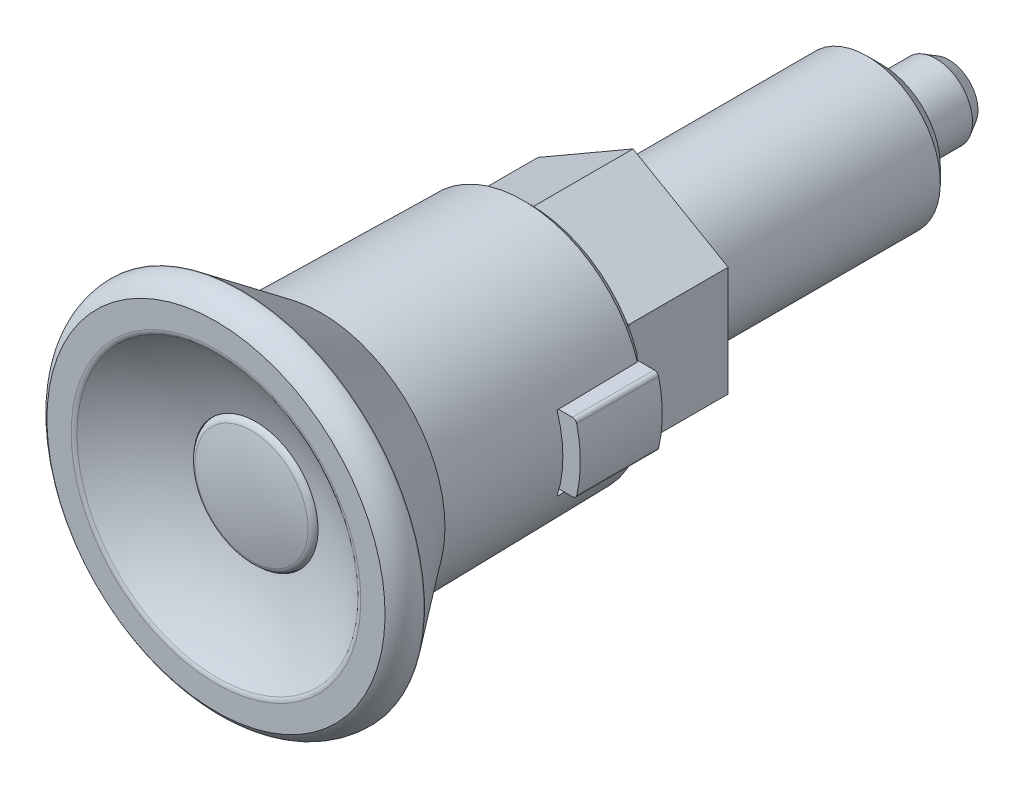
ISO-10303-21;
HEADER;
FILE_DESCRIPTION(('STEP AP214'),'2;1');
FILE_NAME('part.step','',(''),(''),'','','');
FILE_SCHEMA(('AUTOMOTIVE_DESIGN { 1 0 10303 214 1 1 1 1 }'));
ENDSEC;
DATA;
#1=APPLICATION_CONTEXT('core data for automotive mechanical design processes');
#2=APPLICATION_PROTOCOL_DEFINITION('international standard','automotive_design',2000,#1);
#3=PRODUCT_CONTEXT('',#1,'mechanical');
#4=PRODUCT('Part','Part','',(#3));
#5=PRODUCT_RELATED_PRODUCT_CATEGORY('part','',(#4));
#6=PRODUCT_DEFINITION_FORMATION('','',#4);
#7=PRODUCT_DEFINITION_CONTEXT('part definition',#1,'design');
#8=PRODUCT_DEFINITION('design','',#6,#7);
#9=PRODUCT_DEFINITION_SHAPE('','',#8);
#10=(LENGTH_UNIT() NAMED_UNIT(*) SI_UNIT(.MILLI.,.METRE.));
#11=(NAMED_UNIT(*) PLANE_ANGLE_UNIT() SI_UNIT($,.RADIAN.));
#12=(NAMED_UNIT(*) SI_UNIT($,.STERADIAN.) SOLID_ANGLE_UNIT());
#13=UNCERTAINTY_MEASURE_WITH_UNIT(LENGTH_MEASURE(1.E-05),#10,'distance_accuracy_value','');
#14=(GEOMETRIC_REPRESENTATION_CONTEXT(3) GLOBAL_UNCERTAINTY_ASSIGNED_CONTEXT((#13)) GLOBAL_UNIT_ASSIGNED_CONTEXT((#10,
#11,#12)) REPRESENTATION_CONTEXT('',''));
#15=CARTESIAN_POINT('',(0.,0.,0.));
#16=DIRECTION('',(0.,0.,1.));
#17=DIRECTION('',(1.,0.,0.));
#18=AXIS2_PLACEMENT_3D('',#15,#16,#17);
#19=CARTESIAN_POINT('',(6.,-3.05,13.1));
#20=DIRECTION('',(0.,0.,1.));
#21=DIRECTION('',(0.,-1.,0.));
#22=AXIS2_PLACEMENT_3D('',#19,#20,#21);
#23=PLANE('',#22);
#24=DIRECTION('',(0.,-1.,0.));
#25=VECTOR('',#24,1.);
#26=CARTESIAN_POINT('',(6.5,3.05,13.1));
#27=LINE('',#26,#25);
#28=CARTESIAN_POINT('',(6.5,2.55,13.1));
#29=VERTEX_POINT('',#28);
#30=CARTESIAN_POINT('',(6.5,-2.55,13.1));
#31=VERTEX_POINT('',#30);
#32=EDGE_CURVE('E160',#29,#31,#27,.T.);
#33=ORIENTED_EDGE('',*,*,#32,.F.);
#34=DIRECTION('',(-1.,0.,0.));
#35=VECTOR('',#34,1.);
#36=CARTESIAN_POINT('',(12.5,2.55,13.1));
#37=LINE('',#36,#35);
#38=CARTESIAN_POINT('',(7.90538056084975,2.55,13.1));
#39=VERTEX_POINT('',#38);
#40=EDGE_CURVE('E186',#39,#29,#37,.T.);
#41=ORIENTED_EDGE('',*,*,#40,.F.);
#42=CARTESIAN_POINT('',(0.,0.,13.1));
#43=DIRECTION('',(0.,0.,1.));
#44=DIRECTION('',(0.,-1.,0.));
#45=AXIS2_PLACEMENT_3D('',#42,#43,#44);
#46=CIRCLE('',#45,8.30647589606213);
#47=CARTESIAN_POINT('',(7.90538056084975,-2.55,13.1));
#48=VERTEX_POINT('',#47);
#49=EDGE_CURVE('E285',#48,#39,#46,.T.);
#50=ORIENTED_EDGE('',*,*,#49,.F.);
#51=DIRECTION('',(1.,0.,0.));
#52=VECTOR('',#51,1.);
#53=CARTESIAN_POINT('',(6.5,-2.55,13.1));
#54=LINE('',#53,#52);
#55=EDGE_CURVE('E184',#31,#48,#54,.T.);
#56=ORIENTED_EDGE('',*,*,#55,.F.);
#57=EDGE_LOOP('',(#33,#41,#50,#56));
#58=FACE_BOUND('',#57,.T.);
#59=ADVANCED_FACE('F14',(#58),#23,.F.);
#60=CARTESIAN_POINT('',(5.9,-2.95,12.8));
#61=DIRECTION('',(0.,0.,1.));
#62=DIRECTION('',(0.,-1.,0.));
#63=AXIS2_PLACEMENT_3D('',#60,#61,#62);
#64=PLANE('',#63);
#65=DIRECTION('',(-1.,0.,0.));
#66=VECTOR('',#65,1.);
#67=CARTESIAN_POINT('',(8.65789109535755,2.35,12.8));
#68=LINE('',#67,#66);
#69=CARTESIAN_POINT('',(8.65789109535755,2.35,12.8));
#70=VERTEX_POINT('',#69);
#71=CARTESIAN_POINT('',(6.5,2.35,12.8));
#72=VERTEX_POINT('',#71);
#73=EDGE_CURVE('E513',#70,#72,#68,.T.);
#74=ORIENTED_EDGE('',*,*,#73,.T.);
#75=DIRECTION('',(0.,-1.,0.));
#76=VECTOR('',#75,1.);
#77=CARTESIAN_POINT('',(6.5,-2.95,12.8));
#78=LINE('',#77,#76);
#79=CARTESIAN_POINT('',(6.5,-2.35,12.8));
#80=VERTEX_POINT('',#79);
#81=EDGE_CURVE('E178',#72,#80,#78,.T.);
#82=ORIENTED_EDGE('',*,*,#81,.T.);
#83=DIRECTION('',(1.,0.,0.));
#84=VECTOR('',#83,1.);
#85=CARTESIAN_POINT('',(6.5,-2.35,12.8));
#86=LINE('',#85,#84);
#87=CARTESIAN_POINT('',(8.65789109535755,-2.35,12.8));
#88=VERTEX_POINT('',#87);
#89=EDGE_CURVE('E517',#80,#88,#86,.T.);
#90=ORIENTED_EDGE('',*,*,#89,.T.);
#91=CARTESIAN_POINT('',(8.65789109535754,-2.05,12.8));
#92=DIRECTION('',(0.,0.,1.));
#93=DIRECTION('',(1.,0.,0.));
#94=AXIS2_PLACEMENT_3D('',#91,#92,#93);
#95=CIRCLE('',#94,0.3);
#96=CARTESIAN_POINT('',(8.94963738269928,-2.11988636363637,12.8));
#97=VERTEX_POINT('',#96);
#98=EDGE_CURVE('E531',#88,#97,#95,.T.);
#99=ORIENTED_EDGE('',*,*,#98,.T.);
#100=CARTESIAN_POINT('',(0.100000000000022,0.,12.8));
#101=DIRECTION('',(0.,0.,1.));
#102=DIRECTION('',(1.,0.,0.));
#103=AXIS2_PLACEMENT_3D('',#100,#101,#102);
#104=CIRCLE('',#103,9.1);
#105=CARTESIAN_POINT('',(8.94963738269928,2.11988636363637,12.8));
#106=VERTEX_POINT('',#105);
#107=EDGE_CURVE('E529',#97,#106,#104,.T.);
#108=ORIENTED_EDGE('',*,*,#107,.T.);
#109=CARTESIAN_POINT('',(8.65789109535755,2.05,12.8));
#110=DIRECTION('',(0.,0.,1.));
#111=DIRECTION('',(1.,0.,0.));
#112=AXIS2_PLACEMENT_3D('',#109,#110,#111);
#113=CIRCLE('',#112,0.3);
#114=EDGE_CURVE('E527',#106,#70,#113,.T.);
#115=ORIENTED_EDGE('',*,*,#114,.T.);
#116=EDGE_LOOP('',(#74,#82,#90,#99,#108,#115));
#117=FACE_BOUND('',#116,.T.);
#118=ADVANCED_FACE('F269',(#117),#64,.T.);
#119=CARTESIAN_POINT('',(5.9,-2.95,7.2));
#120=DIRECTION('',(0.,0.,1.));
#121=DIRECTION('',(0.,-1.,0.));
#122=AXIS2_PLACEMENT_3D('',#119,#120,#121);
#123=PLANE('',#122);
#124=DIRECTION('',(0.,-1.,0.));
#125=VECTOR('',#124,1.);
#126=CARTESIAN_POINT('',(6.5,-2.95,7.2));
#127=LINE('',#126,#125);
#128=CARTESIAN_POINT('',(6.5,2.35,7.2));
#129=VERTEX_POINT('',#128);
#130=CARTESIAN_POINT('',(6.5,-2.35,7.2));
#131=VERTEX_POINT('',#130);
#132=EDGE_CURVE('E9',#129,#131,#127,.T.);
#133=ORIENTED_EDGE('',*,*,#132,.F.);
#134=DIRECTION('',(-1.,0.,0.));
#135=VECTOR('',#134,1.);
#136=CARTESIAN_POINT('',(8.65789109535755,2.35,7.2));
#137=LINE('',#136,#135);
#138=CARTESIAN_POINT('',(8.65789109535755,2.35,7.2));
#139=VERTEX_POINT('',#138);
#140=EDGE_CURVE('E514',#139,#129,#137,.T.);
#141=ORIENTED_EDGE('',*,*,#140,.F.);
#142=CARTESIAN_POINT('',(8.65789109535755,2.05,7.2));
#143=DIRECTION('',(0.,0.,1.));
#144=DIRECTION('',(1.,0.,0.));
#145=AXIS2_PLACEMENT_3D('',#142,#143,#144);
#146=CIRCLE('',#145,0.3);
#147=CARTESIAN_POINT('',(8.94963738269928,2.11988636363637,7.2));
#148=VERTEX_POINT('',#147);
#149=EDGE_CURVE('E518',#148,#139,#146,.T.);
#150=ORIENTED_EDGE('',*,*,#149,.F.);
#151=CARTESIAN_POINT('',(0.100000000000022,0.,7.2));
#152=DIRECTION('',(0.,0.,1.));
#153=DIRECTION('',(1.,0.,0.));
#154=AXIS2_PLACEMENT_3D('',#151,#152,#153);
#155=CIRCLE('',#154,9.1);
#156=CARTESIAN_POINT('',(8.94963738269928,-2.11988636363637,7.2));
#157=VERTEX_POINT('',#156);
#158=EDGE_CURVE('E520',#157,#148,#155,.T.);
#159=ORIENTED_EDGE('',*,*,#158,.F.);
#160=CARTESIAN_POINT('',(8.65789109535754,-2.05,7.2));
#161=DIRECTION('',(0.,0.,1.));
#162=DIRECTION('',(1.,0.,0.));
#163=AXIS2_PLACEMENT_3D('',#160,#161,#162);
#164=CIRCLE('',#163,0.3);
#165=CARTESIAN_POINT('',(8.65789109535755,-2.35,7.2));
#166=VERTEX_POINT('',#165);
#167=EDGE_CURVE('E522',#166,#157,#164,.T.);
#168=ORIENTED_EDGE('',*,*,#167,.F.);
#169=DIRECTION('',(1.,0.,0.));
#170=VECTOR('',#169,1.);
#171=CARTESIAN_POINT('',(6.5,-2.35,7.2));
#172=LINE('',#171,#170);
#173=EDGE_CURVE('E524',#131,#166,#172,.T.);
#174=ORIENTED_EDGE('',*,*,#173,.F.);
#175=EDGE_LOOP('',(#133,#141,#150,#159,#168,#174));
#176=FACE_BOUND('',#175,.T.);
#177=ADVANCED_FACE('F274',(#176),#123,.F.);
#178=CARTESIAN_POINT('',(0.,0.,41.2));
#179=DIRECTION('',(0.,0.,-1.));
#180=DIRECTION('',(-1.,0.,0.));
#181=AXIS2_PLACEMENT_3D('',#178,#179,#180);
#182=SPHERICAL_SURFACE('',#181,16.);
#183=CARTESIAN_POINT('',(0.,0.,28.4));
#184=DIRECTION('',(0.,0.,-1.));
#185=DIRECTION('',(0.,1.,0.));
#186=AXIS2_PLACEMENT_3D('',#183,#184,#185);
#187=CIRCLE('',#186,9.6);
#188=CARTESIAN_POINT('',(-9.59999999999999,0.,28.4));
#189=VERTEX_POINT('',#188);
#190=EDGE_CURVE('E286',#189,#189,#187,.T.);
#191=CARTESIAN_POINT('',(0.,0.,25.7747771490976));
#192=DIRECTION('',(0.,0.,1.));
#193=DIRECTION('',(0.,-1.,0.));
#194=AXIS2_PLACEMENT_3D('',#191,#192,#193);
#195=CIRCLE('',#194,4.25);
#196=CARTESIAN_POINT('',(-4.24999999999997,0.,25.7747771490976));
#197=VERTEX_POINT('',#196);
#198=EDGE_CURVE('E476',#197,#197,#195,.T.);
#199=CARTESIAN_POINT('',(-9.59999999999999,0.,28.4));
#200=CARTESIAN_POINT('',(-9.55004681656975,0.,28.3625350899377));
#201=CARTESIAN_POINT('',(-9.49987429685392,0.,28.3253626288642));
#202=CARTESIAN_POINT('',(-9.39909750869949,0.,28.2516076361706));
#203=CARTESIAN_POINT('',(-9.34849324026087,0.,28.2150251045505));
#204=CARTESIAN_POINT('',(-9.24685987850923,0.,28.1424550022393));
#205=CARTESIAN_POINT('',(-9.19583078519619,0.,28.1064674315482));
#206=CARTESIAN_POINT('',(-9.09335477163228,0.,28.0350921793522));
#207=CARTESIAN_POINT('',(-9.04190785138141,0.,27.9997044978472));
#208=CARTESIAN_POINT('',(-8.93860323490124,0.,27.929533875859));
#209=CARTESIAN_POINT('',(-8.88674553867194,0.,27.8947509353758));
#210=CARTESIAN_POINT('',(-8.78262647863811,0.,27.8257945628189));
#211=CARTESIAN_POINT('',(-8.73036511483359,0.,27.7916211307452));
#212=CARTESIAN_POINT('',(-8.62544588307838,0.,27.7238884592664));
#213=CARTESIAN_POINT('',(-8.57278801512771,0.,27.6903292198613));
#214=CARTESIAN_POINT('',(-8.46708299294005,0.,27.6238295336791));
#215=CARTESIAN_POINT('',(-8.41403583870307,0.,27.5908890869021));
#216=CARTESIAN_POINT('',(-8.30755951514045,0.,27.5256315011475));
#217=CARTESIAN_POINT('',(-8.2541303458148,0.,27.4933143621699));
#218=CARTESIAN_POINT('',(-8.14689731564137,0.,27.4293078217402));
#219=CARTESIAN_POINT('',(-8.09309345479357,0.,27.3976184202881));
#220=CARTESIAN_POINT('',(-7.98511841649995,0.,27.3348716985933));
#221=CARTESIAN_POINT('',(-7.93094723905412,0.,27.3038143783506));
#222=CARTESIAN_POINT('',(-7.82224499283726,0.,27.2423360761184));
#223=CARTESIAN_POINT('',(-7.76771392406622,0.,27.2119150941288));
#224=CARTESIAN_POINT('',(-7.65829936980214,0.,27.1517136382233));
#225=CARTESIAN_POINT('',(-7.60341588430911,0.,27.1219331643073));
#226=CARTESIAN_POINT('',(-7.49330401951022,0.,27.0630168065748));
#227=CARTESIAN_POINT('',(-7.43807564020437,0.,27.0338809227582));
#228=CARTESIAN_POINT('',(-7.32728155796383,0.,26.9762577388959));
#229=CARTESIAN_POINT('',(-7.27171585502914,0.,26.9477704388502));
#230=CARTESIAN_POINT('',(-7.16025474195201,0.,26.8914483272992));
#231=CARTESIAN_POINT('',(-7.10435933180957,0.,26.863613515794));
#232=CARTESIAN_POINT('',(-6.99224646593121,0.,26.8086001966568));
#233=CARTESIAN_POINT('',(-6.93602901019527,0.,26.7814216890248));
#234=CARTESIAN_POINT('',(-6.82327975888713,0.,26.7277247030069));
#235=CARTESIAN_POINT('',(-6.76674796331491,0.,26.701206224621));
#236=CARTESIAN_POINT('',(-6.65337778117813,0.,26.6488329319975));
#237=CARTESIAN_POINT('',(-6.59653939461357,0.,26.6229781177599));
#238=CARTESIAN_POINT('',(-6.48256382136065,0.,26.5719356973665));
#239=CARTESIAN_POINT('',(-6.42542663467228,0.,26.5467480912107));
#240=CARTESIAN_POINT('',(-6.31086129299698,0.,26.4970435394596));
#241=CARTESIAN_POINT('',(-6.25343313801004,0.,26.4725265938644));
#242=CARTESIAN_POINT('',(-6.13829373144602,0.,26.4241667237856));
#243=CARTESIAN_POINT('',(-6.08058247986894,0.,26.400323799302));
#244=CARTESIAN_POINT('',(-5.96488479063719,0.,26.3533152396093));
#245=CARTESIAN_POINT('',(-5.90689835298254,0.,26.3301496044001));
#246=CARTESIAN_POINT('',(-5.79065823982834,0.,26.2844987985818));
#247=CARTESIAN_POINT('',(-5.73240456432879,0.,26.2620136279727));
#248=CARTESIAN_POINT('',(-5.61563796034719,0.,26.2177268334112));
#249=CARTESIAN_POINT('',(-5.55712503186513,0.,26.1959252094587));
#250=CARTESIAN_POINT('',(-5.43984794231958,0.,26.1530084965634));
#251=CARTESIAN_POINT('',(-5.38108378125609,0.,26.1318934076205));
#252=CARTESIAN_POINT('',(-5.26331228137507,0.,26.0903526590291));
#253=CARTESIAN_POINT('',(-5.20430494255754,0.,26.0699269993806));
#254=CARTESIAN_POINT('',(-5.08605517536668,0.,26.0297679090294));
#255=CARTESIAN_POINT('',(-5.02681274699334,0.,26.0100344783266));
#256=CARTESIAN_POINT('',(-4.9081009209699,0.,25.9712625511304));
#257=CARTESIAN_POINT('',(-4.84863152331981,0.,25.952224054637));
#258=CARTESIAN_POINT('',(-4.72947391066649,0.,25.9148446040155));
#259=CARTESIAN_POINT('',(-4.66978569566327,0.,25.8965036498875));
#260=CARTESIAN_POINT('',(-4.55019862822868,0.,25.8605218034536));
#261=CARTESIAN_POINT('',(-4.4902997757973,0.,25.8428809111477));
#262=CARTESIAN_POINT('',(-4.37029964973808,0.,25.8083015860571));
#263=CARTESIAN_POINT('',(-4.31019837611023,0.,25.7913631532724));
#264=CARTESIAN_POINT('',(-4.24999999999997,0.,25.7747771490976));
#265=B_SPLINE_CURVE_WITH_KNOTS('',3,(#199,#200,#201,#202,#203,#204,#205,#206,#207,#208,#209,
#210,#211,#212,#213,#214,#215,#216,#217,#218,#219,#220,#221,#222,#223,#224,#225,#226,#227,#228,
#229,#230,#231,#232,#233,#234,#235,#236,#237,#238,#239,#240,#241,#242,#243,#244,#245,#246,#247,
#248,#249,#250,#251,#252,#253,#254,#255,#256,#257,#258,#259,#260,#261,#262,#263,#264),
.UNSPECIFIED.,.F.,.F.,(4,2,2,2,2,2,2,2,2,2,2,2,2,2,2,2,2,2,2,2,2,2,2,2,2,2,2,2,2,2,2,2,4),(0.,
0.187323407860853,0.374646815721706,0.561970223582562,0.749293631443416,0.936617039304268,
1.12394044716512,1.31126385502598,1.49858726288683,1.68591067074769,1.87323407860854,
2.0605574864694,2.24788089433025,2.43520430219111,2.62252771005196,2.80985111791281,
2.99717452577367,3.18449793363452,3.37182134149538,3.55914474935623,3.74646815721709,
3.93379156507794,4.12111497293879,4.30843838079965,4.4957617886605,4.68308519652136,
4.87040860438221,5.05773201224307,5.24505542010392,5.43237882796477,5.61970223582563,
5.80702564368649,5.99434905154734),.UNSPECIFIED.);
#266=EDGE_CURVE('BSEAM16',#189,#197,#265,.T.);
#267=ORIENTED_EDGE('',*,*,#190,.F.);
#268=ORIENTED_EDGE('',*,*,#198,.F.);
#269=ORIENTED_EDGE('',*,*,#266,.T.);
#270=ORIENTED_EDGE('',*,*,#266,.F.);
#271=EDGE_LOOP('',(#267,#269,#268,#270));
#272=FACE_BOUND('',#271,.T.);
#273=ADVANCED_FACE('F16',(#272),#182,.F.);
#274=CARTESIAN_POINT('',(0.,0.,7.));
#275=DIRECTION('',(0.,0.,-1.));
#276=DIRECTION('',(0.,1.,0.));
#277=AXIS2_PLACEMENT_3D('',#274,#275,#276);
#278=CONICAL_SURFACE('',#277,6.5,1.36135681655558);
#279=CARTESIAN_POINT('',(-6.5,9.96304015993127,5.85306843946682));
#280=CARTESIAN_POINT('',(-6.5,9.66752036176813,5.90566321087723));
#281=CARTESIAN_POINT('',(-6.5,9.3718825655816,5.95760662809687));
#282=CARTESIAN_POINT('',(-6.5,8.78031384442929,6.05984354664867));
#283=CARTESIAN_POINT('',(-6.5,8.48438291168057,6.11013700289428));
#284=CARTESIAN_POINT('',(-6.5,7.89200816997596,6.20875363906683));
#285=CARTESIAN_POINT('',(-6.5,7.59556415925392,6.25707561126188));
#286=CARTESIAN_POINT('',(-6.5,7.00228457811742,6.35125145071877));
#287=CARTESIAN_POINT('',(-6.5,6.70544900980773,6.39710533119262));
#288=CARTESIAN_POINT('',(-6.5,6.11278728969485,6.4855480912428));
#289=CARTESIAN_POINT('',(-6.5,5.81696338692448,6.52815196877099));
#290=CARTESIAN_POINT('',(-6.5,5.22480385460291,6.60963457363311));
#291=CARTESIAN_POINT('',(-6.5,4.92846823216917,6.6485133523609));
#292=CARTESIAN_POINT('',(-6.5,4.33524852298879,6.72168768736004));
#293=CARTESIAN_POINT('',(-6.5,4.03836447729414,6.75598357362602));
#294=CARTESIAN_POINT('',(-6.5,3.44399920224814,6.81900415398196));
#295=CARTESIAN_POINT('',(-6.5,3.14651797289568,6.84772884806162));
#296=CARTESIAN_POINT('',(-6.5,2.54890034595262,6.89871709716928));
#297=CARTESIAN_POINT('',(-6.5,2.24875991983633,6.92093410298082));
#298=CARTESIAN_POINT('',(-6.5,1.64800063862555,6.95759663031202));
#299=CARTESIAN_POINT('',(-6.5,1.34738178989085,6.97204225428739));
#300=CARTESIAN_POINT('',(-6.5,0.745934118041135,6.99236327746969));
#301=CARTESIAN_POINT('',(-6.5,0.445105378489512,6.9982411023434));
#302=CARTESIAN_POINT('',(-6.5,-0.1565946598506,7.00107848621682));
#303=CARTESIAN_POINT('',(-6.5,-0.457465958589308,6.99803805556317));
#304=CARTESIAN_POINT('',(-6.5,-1.05968701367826,6.98320817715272));
#305=CARTESIAN_POINT('',(-6.5,-1.36103626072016,6.97139844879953));
#306=CARTESIAN_POINT('',(-6.5,-1.96330463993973,6.93968543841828));
#307=CARTESIAN_POINT('',(-6.5,-2.26422376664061,6.91978205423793));
#308=CARTESIAN_POINT('',(-6.5,-2.86561811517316,6.87286386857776));
#309=CARTESIAN_POINT('',(-6.5,-3.16609311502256,6.84584626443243));
#310=CARTESIAN_POINT('',(-6.5,-3.76643560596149,6.78580284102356));
#311=CARTESIAN_POINT('',(-6.5,-4.06630309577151,6.75277700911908));
#312=CARTESIAN_POINT('',(-6.5,-4.65450400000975,6.68306611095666));
#313=CARTESIAN_POINT('',(-6.5,-4.94285868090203,6.64655873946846));
#314=CARTESIAN_POINT('',(-6.5,-5.51906781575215,6.56977109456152));
#315=CARTESIAN_POINT('',(-6.5,-5.80692225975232,6.52949074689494));
#316=CARTESIAN_POINT('',(-6.5,-6.38220087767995,6.44585349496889));
#317=CARTESIAN_POINT('',(-6.5,-6.66962502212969,6.40249638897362));
#318=CARTESIAN_POINT('',(-6.5,-7.24408456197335,6.31327286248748));
#319=CARTESIAN_POINT('',(-6.5,-7.53111995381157,6.26740641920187));
#320=CARTESIAN_POINT('',(-6.5,-8.39184474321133,6.12673714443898));
#321=CARTESIAN_POINT('',(-6.5,-8.96503469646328,6.02888194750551));
#322=CARTESIAN_POINT('',(-6.5,-10.1104163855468,5.82768949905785));
#323=CARTESIAN_POINT('',(-6.5,-10.6826081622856,5.72435247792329));
#324=CARTESIAN_POINT('',(-6.5,-11.8226483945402,5.51451133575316));
#325=CARTESIAN_POINT('',(-6.5,-12.3905013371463,5.40803152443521));
#326=CARTESIAN_POINT('',(-6.5,-13.5256959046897,5.19234893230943));
#327=CARTESIAN_POINT('',(-6.5,-14.093037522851,5.08314611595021));
#328=CARTESIAN_POINT('',(-6.5,-15.2268150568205,4.86284069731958));
#329=CARTESIAN_POINT('',(-6.5,-15.7932513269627,4.7517399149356));
#330=CARTESIAN_POINT('',(-6.5,-16.9258075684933,4.52800454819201));
#331=CARTESIAN_POINT('',(-6.5,-17.4919275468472,4.41536999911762));
#332=CARTESIAN_POINT('',(-6.5,-18.0579385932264,4.30219733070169));
#333=B_SPLINE_CURVE_WITH_KNOTS('',3,(#279,#280,#281,#282,#283,#284,#285,#286,#287,#288,#289,
#290,#291,#292,#293,#294,#295,#296,#297,#298,#299,#300,#301,#302,#303,#304,#305,#306,#307,#308,
#309,#310,#311,#312,#313,#314,#315,#316,#317,#318,#319,#320,#321,#322,#323,#324,#325,#326,#327,
#328,#329,#330,#331,#332),.UNSPECIFIED.,.F.,.F.,(4,2,2,2,2,2,2,2,2,2,2,2,2,2,2,2,2,2,2,2,2,2,2,
2,2,2,4),(0.,0.900493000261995,1.80101058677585,2.70207179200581,3.60312817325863,
4.49973722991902,5.39633391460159,6.2928660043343,7.18939809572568,8.09219464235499,
8.99497928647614,9.89750828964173,10.8000362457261,11.7046579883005,12.6092911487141,
13.5142812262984,14.4192732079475,15.2912129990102,16.1631699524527,17.0351841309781,
17.9072062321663,19.6516084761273,21.3959374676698,23.1291775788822,24.862440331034,
26.5941252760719,28.3257704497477),.UNSPECIFIED.);
#334=CARTESIAN_POINT('',(-6.5,-3.75277674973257,6.78626300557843));
#335=VERTEX_POINT('',#334);
#336=CARTESIAN_POINT('',(-6.5,0.,7.));
#337=VERTEX_POINT('',#336);
#338=EDGE_CURVE('E393',#335,#337,#333,.F.);
#339=ORIENTED_EDGE('',*,*,#338,.F.);
#340=CARTESIAN_POINT('',(0.0002,-7.50566896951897,6.78623846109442));
#341=CARTESIAN_POINT('',(-0.27007835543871,-7.3496236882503,6.81942161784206));
#342=CARTESIAN_POINT('',(-0.540667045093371,-7.19339923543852,6.84951936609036));
#343=CARTESIAN_POINT('',(-1.08244634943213,-6.88060280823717,6.90236604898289));
#344=CARTESIAN_POINT('',(-1.35363709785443,-6.72403075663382,6.92511314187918));
#345=CARTESIAN_POINT('',(-1.89558215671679,-6.41113863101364,6.96200252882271));
#346=CARTESIAN_POINT('',(-2.16633501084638,-6.25481939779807,6.97617261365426));
#347=CARTESIAN_POINT('',(-2.70805859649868,-5.94205513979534,6.99517079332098));
#348=CARTESIAN_POINT('',(-2.97902929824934,-5.7856101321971,7.));
#349=CARTESIAN_POINT('',(-3.52097070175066,-5.47272011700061,7.));
#350=CARTESIAN_POINT('',(-3.79194140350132,-5.31627510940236,6.99517079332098));
#351=CARTESIAN_POINT('',(-4.33366498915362,-5.00351085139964,6.97617261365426));
#352=CARTESIAN_POINT('',(-4.60441784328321,-4.84719161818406,6.96200252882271));
#353=CARTESIAN_POINT('',(-5.14636290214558,-4.53429949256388,6.92511314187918));
#354=CARTESIAN_POINT('',(-5.41755365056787,-4.37772744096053,6.90236604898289));
#355=CARTESIAN_POINT('',(-5.95933295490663,-4.06493101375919,6.84951936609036));
#356=CARTESIAN_POINT('',(-6.22992164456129,-3.9087065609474,6.81942161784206));
#357=CARTESIAN_POINT('',(-6.5002,-3.75266127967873,6.78623846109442));
#358=B_SPLINE_CURVE_WITH_KNOTS('',3,(#340,#341,#342,#343,#344,#345,#346,#347,#348,#349,#350,
#351,#352,#353,#354,#355,#356,#357),.UNSPECIFIED.,.F.,.F.,(4,2,2,2,2,2,2,2,4),(0.,
0.941579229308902,1.88339419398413,2.8221409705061,3.76077600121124,4.69941103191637,
5.63815780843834,6.57997277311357,7.52155200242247),.UNSPECIFIED.);
#359=CARTESIAN_POINT('',(-3.25,-5.62916512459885,7.));
#360=VERTEX_POINT('',#359);
#361=EDGE_CURVE('E331',#360,#335,#358,.T.);
#362=ORIENTED_EDGE('',*,*,#361,.F.);
#363=CARTESIAN_POINT('',(0.,0.,7.));
#364=DIRECTION('',(0.,0.,-1.));
#365=DIRECTION('',(0.,1.,0.));
#366=AXIS2_PLACEMENT_3D('',#363,#364,#365);
#367=CIRCLE('',#366,6.5);
#368=EDGE_CURVE('E442',#360,#337,#367,.T.);
#369=ORIENTED_EDGE('',*,*,#368,.T.);
#370=EDGE_LOOP('',(#339,#362,#369));
#371=FACE_BOUND('',#370,.T.);
#372=ADVANCED_FACE('F350',(#371),#278,.T.);
#373=CARTESIAN_POINT('',(-6.5,3.75277674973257,6.78626300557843));
#374=VERTEX_POINT('',#373);
#375=EDGE_CURVE('E394',#337,#374,#333,.F.);
#376=ORIENTED_EDGE('',*,*,#375,.F.);
#377=CARTESIAN_POINT('',(-3.25,5.62916512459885,7.));
#378=VERTEX_POINT('',#377);
#379=EDGE_CURVE('E444',#337,#378,#367,.T.);
#380=ORIENTED_EDGE('',*,*,#379,.T.);
#381=CARTESIAN_POINT('',(-6.5002,3.75266127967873,6.78623846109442));
#382=CARTESIAN_POINT('',(-6.22992164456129,3.9087065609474,6.81942161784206));
#383=CARTESIAN_POINT('',(-5.95933295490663,4.06493101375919,6.84951936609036));
#384=CARTESIAN_POINT('',(-5.41755365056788,4.37772744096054,6.90236604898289));
#385=CARTESIAN_POINT('',(-5.14636290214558,4.53429949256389,6.92511314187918));
#386=CARTESIAN_POINT('',(-4.60441784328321,4.84719161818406,6.96200252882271));
#387=CARTESIAN_POINT('',(-4.33366498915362,5.00351085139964,6.97617261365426));
#388=CARTESIAN_POINT('',(-3.79194140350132,5.31627510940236,6.99517079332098));
#389=CARTESIAN_POINT('',(-3.52097070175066,5.47272011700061,7.));
#390=CARTESIAN_POINT('',(-2.97902929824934,5.7856101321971,7.));
#391=CARTESIAN_POINT('',(-2.70805859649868,5.94205513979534,6.99517079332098));
#392=CARTESIAN_POINT('',(-2.16633501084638,6.25481939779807,6.97617261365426));
#393=CARTESIAN_POINT('',(-1.89558215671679,6.41113863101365,6.96200252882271));
#394=CARTESIAN_POINT('',(-1.35363709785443,6.72403075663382,6.92511314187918));
#395=CARTESIAN_POINT('',(-1.08244634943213,6.88060280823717,6.90236604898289));
#396=CARTESIAN_POINT('',(-0.540667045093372,7.19339923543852,6.84951936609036));
#397=CARTESIAN_POINT('',(-0.27007835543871,7.34962368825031,6.81942161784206));
#398=CARTESIAN_POINT('',(0.00020000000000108,7.50566896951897,6.78623846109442));
#399=B_SPLINE_CURVE_WITH_KNOTS('',3,(#381,#382,#383,#384,#385,#386,#387,#388,#389,#390,#391,
#392,#393,#394,#395,#396,#397,#398),.UNSPECIFIED.,.F.,.F.,(4,2,2,2,2,2,2,2,4),(0.,
0.941579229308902,1.88339419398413,2.8221409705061,3.76077600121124,4.69941103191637,
5.63815780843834,6.57997277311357,7.52155200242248),.UNSPECIFIED.);
#400=EDGE_CURVE('E401',#374,#378,#399,.T.);
#401=ORIENTED_EDGE('',*,*,#400,.F.);
#402=EDGE_LOOP('',(#376,#380,#401));
#403=FACE_BOUND('',#402,.T.);
#404=ADVANCED_FACE('F469',(#403),#278,.T.);
#405=CARTESIAN_POINT('',(0.,7.50555349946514,6.78626300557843));
#406=VERTEX_POINT('',#405);
#407=EDGE_CURVE('E402',#378,#406,#399,.T.);
#408=ORIENTED_EDGE('',*,*,#407,.F.);
#409=CARTESIAN_POINT('',(3.25,5.62916512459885,7.));
#410=VERTEX_POINT('',#409);
#411=EDGE_CURVE('E190',#378,#410,#367,.T.);
#412=ORIENTED_EDGE('',*,*,#411,.T.);
#413=CARTESIAN_POINT('',(-0.0002,7.50566896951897,6.78623846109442));
#414=CARTESIAN_POINT('',(0.27007835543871,7.3496236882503,6.81942161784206));
#415=CARTESIAN_POINT('',(0.540667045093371,7.19339923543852,6.84951936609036));
#416=CARTESIAN_POINT('',(1.08244634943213,6.88060280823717,6.90236604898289));
#417=CARTESIAN_POINT('',(1.35363709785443,6.72403075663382,6.92511314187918));
#418=CARTESIAN_POINT('',(1.89558215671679,6.41113863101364,6.96200252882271));
#419=CARTESIAN_POINT('',(2.16633501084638,6.25481939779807,6.97617261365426));
#420=CARTESIAN_POINT('',(2.70805859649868,5.94205513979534,6.99517079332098));
#421=CARTESIAN_POINT('',(2.97902929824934,5.7856101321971,7.));
#422=CARTESIAN_POINT('',(3.52097070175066,5.47272011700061,7.));
#423=CARTESIAN_POINT('',(3.79194140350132,5.31627510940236,6.99517079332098));
#424=CARTESIAN_POINT('',(4.33366498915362,5.00351085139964,6.97617261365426));
#425=CARTESIAN_POINT('',(4.60441784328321,4.84719161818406,6.96200252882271));
#426=CARTESIAN_POINT('',(5.14636290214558,4.53429949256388,6.92511314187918));
#427=CARTESIAN_POINT('',(5.41755365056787,4.37772744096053,6.90236604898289));
#428=CARTESIAN_POINT('',(5.95933295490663,4.06493101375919,6.84951936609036));
#429=CARTESIAN_POINT('',(6.22992164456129,3.9087065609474,6.81942161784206));
#430=CARTESIAN_POINT('',(6.5002,3.75266127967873,6.78623846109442));
#431=B_SPLINE_CURVE_WITH_KNOTS('',3,(#413,#414,#415,#416,#417,#418,#419,#420,#421,#422,#423,
#424,#425,#426,#427,#428,#429,#430),.UNSPECIFIED.,.F.,.F.,(4,2,2,2,2,2,2,2,4),(0.,
0.941579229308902,1.88339419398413,2.8221409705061,3.76077600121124,4.69941103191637,
5.63815780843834,6.57997277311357,7.52155200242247),.UNSPECIFIED.);
#432=EDGE_CURVE('E424',#406,#410,#431,.T.);
#433=ORIENTED_EDGE('',*,*,#432,.F.);
#434=EDGE_LOOP('',(#408,#412,#433));
#435=FACE_BOUND('',#434,.T.);
#436=ADVANCED_FACE('F456',(#435),#278,.T.);
#437=CARTESIAN_POINT('',(6.5,3.75277674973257,6.78626300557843));
#438=VERTEX_POINT('',#437);
#439=EDGE_CURVE('E313',#410,#438,#431,.T.);
#440=ORIENTED_EDGE('',*,*,#439,.F.);
#441=CARTESIAN_POINT('',(6.5,0.,7.));
#442=VERTEX_POINT('',#441);
#443=EDGE_CURVE('E191',#410,#442,#367,.T.);
#444=ORIENTED_EDGE('',*,*,#443,.T.);
#445=CARTESIAN_POINT('',(6.5,9.96304015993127,5.85306843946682));
#446=CARTESIAN_POINT('',(6.5,9.66752036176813,5.90566321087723));
#447=CARTESIAN_POINT('',(6.5,9.3718825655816,5.95760662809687));
#448=CARTESIAN_POINT('',(6.5,8.78031384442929,6.05984354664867));
#449=CARTESIAN_POINT('',(6.5,8.48438291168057,6.11013700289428));
#450=CARTESIAN_POINT('',(6.5,7.89200816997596,6.20875363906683));
#451=CARTESIAN_POINT('',(6.5,7.59556415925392,6.25707561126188));
#452=CARTESIAN_POINT('',(6.5,7.00228457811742,6.35125145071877));
#453=CARTESIAN_POINT('',(6.5,6.70544900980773,6.39710533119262));
#454=CARTESIAN_POINT('',(6.5,6.11278728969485,6.4855480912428));
#455=CARTESIAN_POINT('',(6.5,5.81696338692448,6.52815196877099));
#456=CARTESIAN_POINT('',(6.5,5.22480385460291,6.60963457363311));
#457=CARTESIAN_POINT('',(6.5,4.92846823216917,6.6485133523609));
#458=CARTESIAN_POINT('',(6.5,4.33524852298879,6.72168768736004));
#459=CARTESIAN_POINT('',(6.5,4.03836447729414,6.75598357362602));
#460=CARTESIAN_POINT('',(6.5,3.44399920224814,6.81900415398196));
#461=CARTESIAN_POINT('',(6.5,3.14651797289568,6.84772884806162));
#462=CARTESIAN_POINT('',(6.5,2.54890034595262,6.89871709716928));
#463=CARTESIAN_POINT('',(6.5,2.24875991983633,6.92093410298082));
#464=CARTESIAN_POINT('',(6.5,1.64800063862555,6.95759663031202));
#465=CARTESIAN_POINT('',(6.5,1.34738178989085,6.97204225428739));
#466=CARTESIAN_POINT('',(6.5,0.745934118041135,6.99236327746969));
#467=CARTESIAN_POINT('',(6.5,0.445105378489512,6.9982411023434));
#468=CARTESIAN_POINT('',(6.5,-0.1565946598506,7.00107848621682));
#469=CARTESIAN_POINT('',(6.5,-0.457465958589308,6.99803805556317));
#470=CARTESIAN_POINT('',(6.5,-1.05968701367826,6.98320817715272));
#471=CARTESIAN_POINT('',(6.5,-1.36103626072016,6.97139844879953));
#472=CARTESIAN_POINT('',(6.5,-1.96330463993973,6.93968543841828));
#473=CARTESIAN_POINT('',(6.5,-2.26422376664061,6.91978205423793));
#474=CARTESIAN_POINT('',(6.5,-2.86561811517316,6.87286386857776));
#475=CARTESIAN_POINT('',(6.5,-3.16609311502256,6.84584626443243));
#476=CARTESIAN_POINT('',(6.5,-3.76643560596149,6.78580284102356));
#477=CARTESIAN_POINT('',(6.5,-4.06630309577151,6.75277700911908));
#478=CARTESIAN_POINT('',(6.5,-4.65450400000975,6.68306611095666));
#479=CARTESIAN_POINT('',(6.5,-4.94285868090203,6.64655873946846));
#480=CARTESIAN_POINT('',(6.5,-5.51906781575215,6.56977109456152));
#481=CARTESIAN_POINT('',(6.5,-5.80692225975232,6.52949074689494));
#482=CARTESIAN_POINT('',(6.5,-6.38220087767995,6.44585349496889));
#483=CARTESIAN_POINT('',(6.5,-6.66962502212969,6.40249638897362));
#484=CARTESIAN_POINT('',(6.5,-7.24408456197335,6.31327286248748));
#485=CARTESIAN_POINT('',(6.5,-7.53111995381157,6.26740641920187));
#486=CARTESIAN_POINT('',(6.5,-8.39184474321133,6.12673714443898));
#487=CARTESIAN_POINT('',(6.5,-8.96503469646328,6.02888194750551));
#488=CARTESIAN_POINT('',(6.5,-10.1104163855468,5.82768949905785));
#489=CARTESIAN_POINT('',(6.5,-10.6826081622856,5.72435247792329));
#490=CARTESIAN_POINT('',(6.5,-11.8226483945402,5.51451133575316));
#491=CARTESIAN_POINT('',(6.5,-12.3905013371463,5.40803152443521));
#492=CARTESIAN_POINT('',(6.5,-13.5256959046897,5.19234893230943));
#493=CARTESIAN_POINT('',(6.5,-14.093037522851,5.08314611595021));
#494=CARTESIAN_POINT('',(6.5,-15.2268150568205,4.86284069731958));
#495=CARTESIAN_POINT('',(6.5,-15.7932513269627,4.7517399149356));
#496=CARTESIAN_POINT('',(6.5,-16.9258075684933,4.52800454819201));
#497=CARTESIAN_POINT('',(6.5,-17.4919275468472,4.41536999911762));
#498=CARTESIAN_POINT('',(6.5,-18.0579385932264,4.30219733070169));
#499=B_SPLINE_CURVE_WITH_KNOTS('',3,(#445,#446,#447,#448,#449,#450,#451,#452,#453,#454,#455,
#456,#457,#458,#459,#460,#461,#462,#463,#464,#465,#466,#467,#468,#469,#470,#471,#472,#473,#474,
#475,#476,#477,#478,#479,#480,#481,#482,#483,#484,#485,#486,#487,#488,#489,#490,#491,#492,#493,
#494,#495,#496,#497,#498),.UNSPECIFIED.,.F.,.F.,(4,2,2,2,2,2,2,2,2,2,2,2,2,2,2,2,2,2,2,2,2,2,2,
2,2,2,4),(0.,0.900493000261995,1.80101058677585,2.70207179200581,3.60312817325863,
4.49973722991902,5.39633391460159,6.2928660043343,7.18939809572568,8.09219464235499,
8.99497928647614,9.89750828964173,10.8000362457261,11.7046579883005,12.6092911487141,
13.5142812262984,14.4192732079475,15.2912129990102,16.1631699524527,17.0351841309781,
17.9072062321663,19.6516084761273,21.3959374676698,23.1291775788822,24.862440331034,
26.5941252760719,28.3257704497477),.UNSPECIFIED.);
#500=EDGE_CURVE('E425',#438,#442,#499,.T.);
#501=ORIENTED_EDGE('',*,*,#500,.F.);
#502=EDGE_LOOP('',(#440,#444,#501));
#503=FACE_BOUND('',#502,.T.);
#504=ADVANCED_FACE('F458',(#503),#278,.T.);
#505=CARTESIAN_POINT('',(6.5,-3.75277674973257,6.78626300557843));
#506=VERTEX_POINT('',#505);
#507=EDGE_CURVE('E426',#442,#506,#499,.T.);
#508=ORIENTED_EDGE('',*,*,#507,.F.);
#509=CARTESIAN_POINT('',(3.25,-5.62916512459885,7.));
#510=VERTEX_POINT('',#509);
#511=EDGE_CURVE('E176',#442,#510,#367,.T.);
#512=ORIENTED_EDGE('',*,*,#511,.T.);
#513=CARTESIAN_POINT('',(6.5002,-3.75266127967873,6.78623846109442));
#514=CARTESIAN_POINT('',(6.22992164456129,-3.9087065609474,6.81942161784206));
#515=CARTESIAN_POINT('',(5.95933295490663,-4.06493101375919,6.84951936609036));
#516=CARTESIAN_POINT('',(5.41755365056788,-4.37772744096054,6.90236604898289));
#517=CARTESIAN_POINT('',(5.14636290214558,-4.53429949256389,6.92511314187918));
#518=CARTESIAN_POINT('',(4.60441784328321,-4.84719161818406,6.96200252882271));
#519=CARTESIAN_POINT('',(4.33366498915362,-5.00351085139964,6.97617261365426));
#520=CARTESIAN_POINT('',(3.79194140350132,-5.31627510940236,6.99517079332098));
#521=CARTESIAN_POINT('',(3.52097070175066,-5.47272011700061,7.));
#522=CARTESIAN_POINT('',(2.97902929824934,-5.7856101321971,7.));
#523=CARTESIAN_POINT('',(2.70805859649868,-5.94205513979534,6.99517079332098));
#524=CARTESIAN_POINT('',(2.16633501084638,-6.25481939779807,6.97617261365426));
#525=CARTESIAN_POINT('',(1.89558215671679,-6.41113863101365,6.96200252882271));
#526=CARTESIAN_POINT('',(1.35363709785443,-6.72403075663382,6.92511314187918));
#527=CARTESIAN_POINT('',(1.08244634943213,-6.88060280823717,6.90236604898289));
#528=CARTESIAN_POINT('',(0.540667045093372,-7.19339923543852,6.84951936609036));
#529=CARTESIAN_POINT('',(0.27007835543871,-7.34962368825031,6.81942161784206));
#530=CARTESIAN_POINT('',(-0.00020000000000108,-7.50566896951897,6.78623846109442));
#531=B_SPLINE_CURVE_WITH_KNOTS('',3,(#513,#514,#515,#516,#517,#518,#519,#520,#521,#522,#523,
#524,#525,#526,#527,#528,#529,#530),.UNSPECIFIED.,.F.,.F.,(4,2,2,2,2,2,2,2,4),(0.,
0.941579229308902,1.88339419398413,2.8221409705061,3.76077600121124,4.69941103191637,
5.63815780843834,6.57997277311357,7.52155200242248),.UNSPECIFIED.);
#532=EDGE_CURVE('E431',#506,#510,#531,.T.);
#533=ORIENTED_EDGE('',*,*,#532,.F.);
#534=EDGE_LOOP('',(#508,#512,#533));
#535=FACE_BOUND('',#534,.T.);
#536=ADVANCED_FACE('F460',(#535),#278,.T.);
#537=CARTESIAN_POINT('',(0.,-7.50555349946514,6.78626300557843));
#538=VERTEX_POINT('',#537);
#539=EDGE_CURVE('E343',#510,#538,#531,.T.);
#540=ORIENTED_EDGE('',*,*,#539,.F.);
#541=EDGE_CURVE('E188',#510,#360,#367,.T.);
#542=ORIENTED_EDGE('',*,*,#541,.T.);
#543=EDGE_CURVE('E29',#538,#360,#358,.T.);
#544=ORIENTED_EDGE('',*,*,#543,.F.);
#545=EDGE_LOOP('',(#540,#542,#544));
#546=FACE_BOUND('',#545,.T.);
#547=ADVANCED_FACE('F242',(#546),#278,.T.);
#548=CARTESIAN_POINT('',(0.,0.,21.3));
#549=DIRECTION('',(0.,0.,1.));
#550=DIRECTION('',(0.,-1.,0.));
#551=AXIS2_PLACEMENT_3D('',#548,#549,#550);
#552=CONICAL_SURFACE('',#551,8.44960742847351,0.0174532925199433);
#553=CARTESIAN_POINT('',(8.02901338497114,-2.55,19.8458045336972));
#554=CARTESIAN_POINT('',(7.95788487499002,-2.55,15.9617523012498));
#555=CARTESIAN_POINT('',(7.88666240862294,-2.55,12.0777017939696));
#556=CARTESIAN_POINT('',(7.74402956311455,-2.55,4.30960422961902));
#557=CARTESIAN_POINT('',(7.67261918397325,-2.55,0.42555717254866));
#558=CARTESIAN_POINT('',(7.60111484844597,-2.55,-3.45848815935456));
#559=B_SPLINE_CURVE_WITH_KNOTS('',3,(#553,#554,#555,#556,#557,#558),.UNSPECIFIED.,.F.,.F.,(4,2,
4),(0.,11.6541103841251,23.3082207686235),.UNSPECIFIED.);
#560=CARTESIAN_POINT('',(7.80260763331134,-2.55,7.4999238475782));
#561=VERTEX_POINT('',#560);
#562=EDGE_CURVE('E230',#48,#561,#559,.T.);
#563=ORIENTED_EDGE('',*,*,#562,.F.);
#564=ORIENTED_EDGE('',*,*,#49,.T.);
#565=CARTESIAN_POINT('',(7.60111484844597,2.55,-3.45848815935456));
#566=CARTESIAN_POINT('',(7.67261918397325,2.55,0.42555717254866));
#567=CARTESIAN_POINT('',(7.74402956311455,2.55,4.30960422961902));
#568=CARTESIAN_POINT('',(7.88666240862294,2.55,12.0777017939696));
#569=CARTESIAN_POINT('',(7.95788487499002,2.55,15.9617523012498));
#570=CARTESIAN_POINT('',(8.02901338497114,2.55,19.8458045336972));
#571=B_SPLINE_CURVE_WITH_KNOTS('',3,(#565,#566,#567,#568,#569,#570),.UNSPECIFIED.,.F.,.F.,(4,2,
4),(0.,11.6541103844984,23.3082207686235),.UNSPECIFIED.);
#572=CARTESIAN_POINT('',(7.80260763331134,2.55,7.49992384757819));
#573=VERTEX_POINT('',#572);
#574=EDGE_CURVE('E202',#573,#39,#571,.T.);
#575=ORIENTED_EDGE('',*,*,#574,.F.);
#576=CARTESIAN_POINT('',(0.,0.,7.4999238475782));
#577=DIRECTION('',(0.,0.,-1.));
#578=DIRECTION('',(0.,1.,0.));
#579=AXIS2_PLACEMENT_3D('',#576,#577,#578);
#580=CIRCLE('',#579,8.20872620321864);
#581=EDGE_CURVE('E848',#561,#573,#580,.T.);
#582=ORIENTED_EDGE('',*,*,#581,.F.);
#583=EDGE_LOOP('',(#563,#564,#575,#582));
#584=FACE_BOUND('',#583,.T.);
#585=CARTESIAN_POINT('',(0.,0.,21.3));
#586=DIRECTION('',(0.,0.,-1.));
#587=DIRECTION('',(0.,1.,0.));
#588=AXIS2_PLACEMENT_3D('',#585,#586,#587);
#589=CIRCLE('',#588,8.44960742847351);
#590=CARTESIAN_POINT('',(0.,8.44960742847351,21.3));
#591=VERTEX_POINT('',#590);
#592=EDGE_CURVE('E851',#591,#591,#589,.T.);
#593=ORIENTED_EDGE('',*,*,#592,.T.);
#594=EDGE_LOOP('',(#593));
#595=FACE_BOUND('',#594,.T.);
#596=ADVANCED_FACE('F238',(#584,#595),#552,.T.);
#597=CARTESIAN_POINT('',(0.,0.,7.4999238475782));
#598=DIRECTION('',(0.,0.,1.));
#599=DIRECTION('',(0.,-1.,0.));
#600=AXIS2_PLACEMENT_3D('',#597,#598,#599);
#601=CONICAL_SURFACE('',#600,8.20872620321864,0.794124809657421);
#602=CARTESIAN_POINT('',(9.81482161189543,-2.55,9.39844143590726));
#603=CARTESIAN_POINT('',(9.60817850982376,-2.55,9.20190189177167));
#604=CARTESIAN_POINT('',(9.4013435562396,-2.55,9.00556447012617));
#605=CARTESIAN_POINT('',(8.98719931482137,-2.55,8.61339078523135));
#606=CARTESIAN_POINT('',(8.77989002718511,-2.55,8.41755452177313));
#607=CARTESIAN_POINT('',(8.15715952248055,-2.55,7.83098504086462));
#608=CARTESIAN_POINT('',(7.7408908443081,-2.55,7.44114842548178));
#609=CARTESIAN_POINT('',(7.11382355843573,-2.55,6.85921981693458));
#610=CARTESIAN_POINT('',(6.90434610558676,-2.55,6.66570466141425));
#611=CARTESIAN_POINT('',(6.48425299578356,-2.55,6.27991799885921));
#612=CARTESIAN_POINT('',(6.27363735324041,-2.55,6.08764647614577));
#613=CARTESIAN_POINT('',(5.85089886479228,-2.55,5.7047172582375));
#614=CARTESIAN_POINT('',(5.63877585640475,-2.55,5.51405974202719));
#615=CARTESIAN_POINT('',(5.31909432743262,-2.55,5.22974713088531));
#616=CARTESIAN_POINT('',(5.21228200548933,-2.55,5.13525319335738));
#617=CARTESIAN_POINT('',(4.99806763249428,-2.55,4.94693389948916));
#618=CARTESIAN_POINT('',(4.89066557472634,-2.55,4.85310855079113));
#619=CARTESIAN_POINT('',(4.78292376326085,-2.55,4.75967322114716));
#620=B_SPLINE_CURVE_WITH_KNOTS('',3,(#602,#603,#604,#605,#606,#607,#608,#609,#610,#611,#612,
#613,#614,#615,#616,#617,#618,#619),.UNSPECIFIED.,.F.,.F.,(4,2,2,2,2,2,2,2,4),(0.,
0.855547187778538,1.71109401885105,3.42200195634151,4.27754504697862,5.13307733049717,
5.98870327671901,6.41653462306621,6.84437085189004),.UNSPECIFIED.);
#621=CARTESIAN_POINT('',(7.26550067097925,-2.55,7.));
#622=VERTEX_POINT('',#621);
#623=EDGE_CURVE('E183',#561,#622,#620,.T.);
#624=ORIENTED_EDGE('',*,*,#623,.F.);
#625=ORIENTED_EDGE('',*,*,#581,.T.);
#626=CARTESIAN_POINT('',(4.78292376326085,2.55,4.75967322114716));
#627=CARTESIAN_POINT('',(4.89066557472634,2.55,4.85310855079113));
#628=CARTESIAN_POINT('',(4.99806763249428,2.55,4.94693389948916));
#629=CARTESIAN_POINT('',(5.21228200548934,2.55,5.13525319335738));
#630=CARTESIAN_POINT('',(5.31909432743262,2.55,5.22974713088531));
#631=CARTESIAN_POINT('',(5.63877585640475,2.55,5.51405974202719));
#632=CARTESIAN_POINT('',(5.85089886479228,2.55,5.7047172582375));
#633=CARTESIAN_POINT('',(6.27363735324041,2.55,6.08764647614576));
#634=CARTESIAN_POINT('',(6.48425299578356,2.55,6.27991799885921));
#635=CARTESIAN_POINT('',(6.90434610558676,2.55,6.66570466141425));
#636=CARTESIAN_POINT('',(7.11382355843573,2.55,6.85921981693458));
#637=CARTESIAN_POINT('',(7.7408908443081,2.55,7.44114842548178));
#638=CARTESIAN_POINT('',(8.15715952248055,2.55,7.83098504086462));
#639=CARTESIAN_POINT('',(8.77989002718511,2.55,8.41755452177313));
#640=CARTESIAN_POINT('',(8.98719931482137,2.55,8.61339078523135));
#641=CARTESIAN_POINT('',(9.40134355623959,2.55,9.00556447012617));
#642=CARTESIAN_POINT('',(9.60817850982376,2.55,9.20190189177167));
#643=CARTESIAN_POINT('',(9.81482161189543,2.55,9.39844143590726));
#644=B_SPLINE_CURVE_WITH_KNOTS('',3,(#626,#627,#628,#629,#630,#631,#632,#633,#634,#635,#636,
#637,#638,#639,#640,#641,#642,#643),.UNSPECIFIED.,.F.,.F.,(4,2,2,2,2,2,2,2,4),(0.,
0.427836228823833,0.855667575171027,1.71129352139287,2.56682580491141,3.42236889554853,
5.13327683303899,5.9888236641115,6.84437085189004),.UNSPECIFIED.);
#645=CARTESIAN_POINT('',(7.26550067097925,2.55,7.));
#646=VERTEX_POINT('',#645);
#647=EDGE_CURVE('E165',#646,#573,#644,.T.);
#648=ORIENTED_EDGE('',*,*,#647,.F.);
#649=CARTESIAN_POINT('',(0.,0.,7.));
#650=DIRECTION('',(0.,0.,-1.));
#651=DIRECTION('',(0.,1.,0.));
#652=AXIS2_PLACEMENT_3D('',#649,#650,#651);
#653=CIRCLE('',#652,7.7);
#654=EDGE_CURVE('E236',#622,#646,#653,.T.);
#655=ORIENTED_EDGE('',*,*,#654,.F.);
#656=EDGE_LOOP('',(#624,#625,#648,#655));
#657=FACE_BOUND('',#656,.T.);
#658=ADVANCED_FACE('F209',(#657),#601,.T.);
#659=CARTESIAN_POINT('',(7.7,0.,7.));
#660=DIRECTION('',(0.,0.,1.));
#661=DIRECTION('',(0.,-1.,0.));
#662=AXIS2_PLACEMENT_3D('',#659,#660,#661);
#663=PLANE('',#662);
#664=ORIENTED_EDGE('',*,*,#379,.F.);
#665=ORIENTED_EDGE('',*,*,#368,.F.);
#666=ORIENTED_EDGE('',*,*,#541,.F.);
#667=ORIENTED_EDGE('',*,*,#511,.F.);
#668=DIRECTION('',(0.,1.,0.));
#669=VECTOR('',#668,1.);
#670=CARTESIAN_POINT('',(6.5,3.05,7.));
#671=LINE('',#670,#669);
#672=CARTESIAN_POINT('',(6.5,-2.55,7.));
#673=VERTEX_POINT('',#672);
#674=EDGE_CURVE('E157',#673,#442,#671,.T.);
#675=ORIENTED_EDGE('',*,*,#674,.F.);
#676=DIRECTION('',(1.,0.,0.));
#677=VECTOR('',#676,1.);
#678=CARTESIAN_POINT('',(6.5,-2.55,7.));
#679=LINE('',#678,#677);
#680=EDGE_CURVE('E173',#673,#622,#679,.T.);
#681=ORIENTED_EDGE('',*,*,#680,.T.);
#682=ORIENTED_EDGE('',*,*,#654,.T.);
#683=DIRECTION('',(1.,0.,0.));
#684=VECTOR('',#683,1.);
#685=CARTESIAN_POINT('',(7.7,2.55,7.));
#686=LINE('',#685,#684);
#687=CARTESIAN_POINT('',(6.5,2.55,7.));
#688=VERTEX_POINT('',#687);
#689=EDGE_CURVE('E283',#688,#646,#686,.T.);
#690=ORIENTED_EDGE('',*,*,#689,.F.);
#691=EDGE_CURVE('E179',#442,#688,#671,.T.);
#692=ORIENTED_EDGE('',*,*,#691,.F.);
#693=ORIENTED_EDGE('',*,*,#443,.F.);
#694=ORIENTED_EDGE('',*,*,#411,.F.);
#695=EDGE_LOOP('',(#664,#665,#666,#667,#675,#681,#682,#690,#692,#693,#694));
#696=FACE_BOUND('',#695,.T.);
#697=ADVANCED_FACE('F171',(#696),#663,.F.);
#698=CARTESIAN_POINT('',(0.,0.,28.));
#699=DIRECTION('',(0.,0.,-1.));
#700=DIRECTION('',(0.,1.,0.));
#701=AXIS2_PLACEMENT_3D('',#698,#699,#700);
#702=TOROIDAL_SURFACE('',#701,9.9,0.500000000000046);
#703=ORIENTED_EDGE('',*,*,#190,.T.);
#704=EDGE_LOOP('',(#703));
#705=FACE_BOUND('',#704,.T.);
#706=CARTESIAN_POINT('',(0.,0.,28.5));
#707=DIRECTION('',(0.,0.,-1.));
#708=DIRECTION('',(0.,1.,0.));
#709=AXIS2_PLACEMENT_3D('',#706,#707,#708);
#710=CIRCLE('',#709,9.9);
#711=CARTESIAN_POINT('',(0.,9.9,28.5));
#712=VERTEX_POINT('',#711);
#713=EDGE_CURVE('E289',#712,#712,#710,.T.);
#714=ORIENTED_EDGE('',*,*,#713,.F.);
#715=EDGE_LOOP('',(#714));
#716=FACE_BOUND('',#715,.T.);
#717=ADVANCED_FACE('F258',(#705,#716),#702,.T.);
#718=CARTESIAN_POINT('',(9.9,0.,28.5));
#719=DIRECTION('',(0.,0.,-1.));
#720=DIRECTION('',(0.,1.,0.));
#721=AXIS2_PLACEMENT_3D('',#718,#719,#720);
#722=PLANE('',#721);
#723=CARTESIAN_POINT('',(0.,0.,28.5));
#724=DIRECTION('',(0.,0.,-1.));
#725=DIRECTION('',(0.,1.,0.));
#726=AXIS2_PLACEMENT_3D('',#723,#724,#725);
#727=CIRCLE('',#726,11.5535653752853);
#728=CARTESIAN_POINT('',(0.,11.5535653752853,28.5));
#729=VERTEX_POINT('',#728);
#730=EDGE_CURVE('E861',#729,#729,#727,.T.);
#731=ORIENTED_EDGE('',*,*,#730,.F.);
#732=EDGE_LOOP('',(#731));
#733=FACE_BOUND('',#732,.T.);
#734=ORIENTED_EDGE('',*,*,#713,.T.);
#735=EDGE_LOOP('',(#734));
#736=FACE_BOUND('',#735,.T.);
#737=ADVANCED_FACE('F255',(#733,#736),#722,.F.);
#738=CARTESIAN_POINT('',(0.,0.,26.8));
#739=DIRECTION('',(0.,0.,-1.));
#740=DIRECTION('',(0.,1.,0.));
#741=AXIS2_PLACEMENT_3D('',#738,#739,#740);
#742=TOROIDAL_SURFACE('',#741,10.5,2.);
#743=ORIENTED_EDGE('',*,*,#730,.T.);
#744=EDGE_LOOP('',(#743));
#745=FACE_BOUND('',#744,.T.);
#746=CARTESIAN_POINT('',(0.,0.,26.8));
#747=DIRECTION('',(0.,0.,-1.));
#748=DIRECTION('',(0.,1.,0.));
#749=AXIS2_PLACEMENT_3D('',#746,#747,#748);
#750=CIRCLE('',#749,12.5);
#751=CARTESIAN_POINT('',(0.,12.5,26.8));
#752=VERTEX_POINT('',#751);
#753=EDGE_CURVE('E858',#752,#752,#750,.T.);
#754=ORIENTED_EDGE('',*,*,#753,.F.);
#755=EDGE_LOOP('',(#754));
#756=FACE_BOUND('',#755,.T.);
#757=ADVANCED_FACE('F251',(#745,#756),#742,.T.);
#758=CARTESIAN_POINT('',(0.,0.,7.));
#759=DIRECTION('',(0.,0.,-1.));
#760=DIRECTION('',(0.,1.,0.));
#761=AXIS2_PLACEMENT_3D('',#758,#759,#760);
#762=CYLINDRICAL_SURFACE('',#761,12.5);
#763=CARTESIAN_POINT('',(0.,0.,26.7538582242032));
#764=DIRECTION('',(0.,0.,-1.));
#765=DIRECTION('',(0.,1.,0.));
#766=AXIS2_PLACEMENT_3D('',#763,#764,#765);
#767=CIRCLE('',#766,12.5);
#768=CARTESIAN_POINT('',(0.,12.5,26.7538582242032));
#769=VERTEX_POINT('',#768);
#770=EDGE_CURVE('E853',#769,#769,#767,.T.);
#771=ORIENTED_EDGE('',*,*,#770,.F.);
#772=EDGE_LOOP('',(#771));
#773=FACE_BOUND('',#772,.T.);
#774=ORIENTED_EDGE('',*,*,#753,.T.);
#775=EDGE_LOOP('',(#774));
#776=FACE_BOUND('',#775,.T.);
#777=ADVANCED_FACE('F247',(#773,#776),#762,.T.);
#778=CARTESIAN_POINT('',(0.,0.,26.7538582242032));
#779=DIRECTION('',(0.,0.,1.));
#780=DIRECTION('',(0.,-1.,0.));
#781=AXIS2_PLACEMENT_3D('',#778,#779,#780);
#782=CONICAL_SURFACE('',#781,12.5,0.638790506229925);
#783=ORIENTED_EDGE('',*,*,#592,.F.);
#784=EDGE_LOOP('',(#783));
#785=FACE_BOUND('',#784,.T.);
#786=ORIENTED_EDGE('',*,*,#770,.T.);
#787=EDGE_LOOP('',(#786));
#788=FACE_BOUND('',#787,.T.);
#789=ADVANCED_FACE('F223',(#785,#788),#782,.T.);
#790=CARTESIAN_POINT('',(6.5,-2.55,13.1));
#791=DIRECTION('',(0.,1.,0.));
#792=DIRECTION('',(-1.,0.,0.));
#793=AXIS2_PLACEMENT_3D('',#790,#791,#792);
#794=PLANE('',#793);
#795=ORIENTED_EDGE('',*,*,#562,.T.);
#796=ORIENTED_EDGE('',*,*,#623,.T.);
#797=ORIENTED_EDGE('',*,*,#680,.F.);
#798=DIRECTION('',(0.,0.,-1.));
#799=VECTOR('',#798,1.);
#800=CARTESIAN_POINT('',(6.5,-2.55,13.1));
#801=LINE('',#800,#799);
#802=EDGE_CURVE('E152',#31,#673,#801,.T.);
#803=ORIENTED_EDGE('',*,*,#802,.F.);
#804=ORIENTED_EDGE('',*,*,#55,.T.);
#805=EDGE_LOOP('',(#795,#796,#797,#803,#804));
#806=FACE_BOUND('',#805,.T.);
#807=ADVANCED_FACE('F181',(#806),#794,.T.);
#808=CARTESIAN_POINT('',(12.5,2.55,13.1));
#809=DIRECTION('',(0.,-1.,0.));
#810=DIRECTION('',(1.,0.,0.));
#811=AXIS2_PLACEMENT_3D('',#808,#809,#810);
#812=PLANE('',#811);
#813=ORIENTED_EDGE('',*,*,#574,.T.);
#814=ORIENTED_EDGE('',*,*,#40,.T.);
#815=DIRECTION('',(0.,0.,-1.));
#816=VECTOR('',#815,1.);
#817=CARTESIAN_POINT('',(6.5,2.55,13.1));
#818=LINE('',#817,#816);
#819=EDGE_CURVE('E166',#29,#688,#818,.T.);
#820=ORIENTED_EDGE('',*,*,#819,.T.);
#821=ORIENTED_EDGE('',*,*,#689,.T.);
#822=ORIENTED_EDGE('',*,*,#647,.T.);
#823=EDGE_LOOP('',(#813,#814,#820,#821,#822));
#824=FACE_BOUND('',#823,.T.);
#825=ADVANCED_FACE('F212',(#824),#812,.T.);
#826=CARTESIAN_POINT('',(-6.5,3.75277674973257,0.));
#827=DIRECTION('',(-1.,0.,0.));
#828=DIRECTION('',(0.,-1.,0.));
#829=AXIS2_PLACEMENT_3D('',#826,#827,#828);
#830=PLANE('',#829);
#831=ORIENTED_EDGE('',*,*,#338,.T.);
#832=ORIENTED_EDGE('',*,*,#375,.T.);
#833=DIRECTION('',(0.,0.,1.));
#834=VECTOR('',#833,1.);
#835=CARTESIAN_POINT('',(-6.5,3.75277674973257,0.));
#836=LINE('',#835,#834);
#837=CARTESIAN_POINT('',(-6.5,3.75277674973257,0.));
#838=VERTEX_POINT('',#837);
#839=EDGE_CURVE('E328',#838,#374,#836,.T.);
#840=ORIENTED_EDGE('',*,*,#839,.F.);
#841=DIRECTION('',(0.,-1.,0.));
#842=VECTOR('',#841,1.);
#843=CARTESIAN_POINT('',(-6.5,3.75277674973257,0.));
#844=LINE('',#843,#842);
#845=CARTESIAN_POINT('',(-6.5,-3.75277674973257,0.));
#846=VERTEX_POINT('',#845);
#847=EDGE_CURVE('E37',#838,#846,#844,.T.);
#848=ORIENTED_EDGE('',*,*,#847,.T.);
#849=DIRECTION('',(0.,0.,1.));
#850=VECTOR('',#849,1.);
#851=CARTESIAN_POINT('',(-6.5,-3.75277674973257,0.));
#852=LINE('',#851,#850);
#853=EDGE_CURVE('E327',#846,#335,#852,.T.);
#854=ORIENTED_EDGE('',*,*,#853,.T.);
#855=EDGE_LOOP('',(#831,#832,#840,#848,#854));
#856=FACE_BOUND('',#855,.T.);
#857=ADVANCED_FACE('F217',(#856),#830,.T.);
#858=CARTESIAN_POINT('',(0.,7.50555349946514,0.));
#859=DIRECTION('',(-0.5,0.866025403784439,0.));
#860=DIRECTION('',(-0.866025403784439,-0.5,0.));
#861=AXIS2_PLACEMENT_3D('',#858,#859,#860);
#862=PLANE('',#861);
#863=ORIENTED_EDGE('',*,*,#400,.T.);
#864=ORIENTED_EDGE('',*,*,#407,.T.);
#865=DIRECTION('',(0.,0.,1.));
#866=VECTOR('',#865,1.);
#867=CARTESIAN_POINT('',(0.,7.50555349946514,0.));
#868=LINE('',#867,#866);
#869=CARTESIAN_POINT('',(0.,7.50555349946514,0.));
#870=VERTEX_POINT('',#869);
#871=EDGE_CURVE('E314',#870,#406,#868,.T.);
#872=ORIENTED_EDGE('',*,*,#871,.F.);
#873=DIRECTION('',(-0.866025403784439,-0.5,0.));
#874=VECTOR('',#873,1.);
#875=CARTESIAN_POINT('',(0.,7.50555349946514,0.));
#876=LINE('',#875,#874);
#877=EDGE_CURVE('E318',#870,#838,#876,.T.);
#878=ORIENTED_EDGE('',*,*,#877,.T.);
#879=ORIENTED_EDGE('',*,*,#839,.T.);
#880=EDGE_LOOP('',(#863,#864,#872,#878,#879));
#881=FACE_BOUND('',#880,.T.);
#882=ADVANCED_FACE('F411',(#881),#862,.T.);
#883=CARTESIAN_POINT('',(6.5,3.75277674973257,0.));
#884=DIRECTION('',(0.5,0.866025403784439,0.));
#885=DIRECTION('',(-0.866025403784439,0.5,0.));
#886=AXIS2_PLACEMENT_3D('',#883,#884,#885);
#887=PLANE('',#886);
#888=ORIENTED_EDGE('',*,*,#432,.T.);
#889=ORIENTED_EDGE('',*,*,#439,.T.);
#890=DIRECTION('',(0.,0.,1.));
#891=VECTOR('',#890,1.);
#892=CARTESIAN_POINT('',(6.5,3.75277674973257,0.));
#893=LINE('',#892,#891);
#894=CARTESIAN_POINT('',(6.5,3.75277674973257,0.));
#895=VERTEX_POINT('',#894);
#896=EDGE_CURVE('E297',#895,#438,#893,.T.);
#897=ORIENTED_EDGE('',*,*,#896,.F.);
#898=DIRECTION('',(-0.866025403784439,0.5,0.));
#899=VECTOR('',#898,1.);
#900=CARTESIAN_POINT('',(6.5,3.75277674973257,0.));
#901=LINE('',#900,#899);
#902=EDGE_CURVE('E310',#895,#870,#901,.T.);
#903=ORIENTED_EDGE('',*,*,#902,.T.);
#904=ORIENTED_EDGE('',*,*,#871,.T.);
#905=EDGE_LOOP('',(#888,#889,#897,#903,#904));
#906=FACE_BOUND('',#905,.T.);
#907=ADVANCED_FACE('F308',(#906),#887,.T.);
#908=CARTESIAN_POINT('',(6.5,-3.75277674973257,0.));
#909=DIRECTION('',(1.,0.,0.));
#910=DIRECTION('',(0.,1.,0.));
#911=AXIS2_PLACEMENT_3D('',#908,#909,#910);
#912=PLANE('',#911);
#913=ORIENTED_EDGE('',*,*,#500,.T.);
#914=ORIENTED_EDGE('',*,*,#507,.T.);
#915=DIRECTION('',(0.,0.,1.));
#916=VECTOR('',#915,1.);
#917=CARTESIAN_POINT('',(6.5,-3.75277674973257,0.));
#918=LINE('',#917,#916);
#919=CARTESIAN_POINT('',(6.5,-3.75277674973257,0.));
#920=VERTEX_POINT('',#919);
#921=EDGE_CURVE('E300',#920,#506,#918,.T.);
#922=ORIENTED_EDGE('',*,*,#921,.F.);
#923=DIRECTION('',(0.,1.,0.));
#924=VECTOR('',#923,1.);
#925=CARTESIAN_POINT('',(6.5,0.,0.));
#926=LINE('',#925,#924);
#927=EDGE_CURVE('E22',#920,#895,#926,.T.);
#928=ORIENTED_EDGE('',*,*,#927,.T.);
#929=ORIENTED_EDGE('',*,*,#896,.T.);
#930=EDGE_LOOP('',(#913,#914,#922,#928,#929));
#931=FACE_BOUND('',#930,.T.);
#932=ADVANCED_FACE('F296',(#931),#912,.T.);
#933=CARTESIAN_POINT('',(0.,-7.50555349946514,0.));
#934=DIRECTION('',(0.5,-0.866025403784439,0.));
#935=DIRECTION('',(0.866025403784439,0.5,0.));
#936=AXIS2_PLACEMENT_3D('',#933,#934,#935);
#937=PLANE('',#936);
#938=ORIENTED_EDGE('',*,*,#532,.T.);
#939=ORIENTED_EDGE('',*,*,#539,.T.);
#940=DIRECTION('',(0.,0.,1.));
#941=VECTOR('',#940,1.);
#942=CARTESIAN_POINT('',(0.,-7.50555349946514,0.));
#943=LINE('',#942,#941);
#944=CARTESIAN_POINT('',(0.,-7.50555349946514,0.));
#945=VERTEX_POINT('',#944);
#946=EDGE_CURVE('E334',#945,#538,#943,.T.);
#947=ORIENTED_EDGE('',*,*,#946,.F.);
#948=DIRECTION('',(0.866025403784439,0.5,0.));
#949=VECTOR('',#948,1.);
#950=CARTESIAN_POINT('',(0.,-7.50555349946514,0.));
#951=LINE('',#950,#949);
#952=EDGE_CURVE('E319',#945,#920,#951,.T.);
#953=ORIENTED_EDGE('',*,*,#952,.T.);
#954=ORIENTED_EDGE('',*,*,#921,.T.);
#955=EDGE_LOOP('',(#938,#939,#947,#953,#954));
#956=FACE_BOUND('',#955,.T.);
#957=ADVANCED_FACE('F358',(#956),#937,.T.);
#958=CARTESIAN_POINT('',(-6.5,-3.75277674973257,0.));
#959=DIRECTION('',(-0.5,-0.866025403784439,0.));
#960=DIRECTION('',(0.866025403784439,-0.5,0.));
#961=AXIS2_PLACEMENT_3D('',#958,#959,#960);
#962=PLANE('',#961);
#963=ORIENTED_EDGE('',*,*,#543,.T.);
#964=ORIENTED_EDGE('',*,*,#361,.T.);
#965=ORIENTED_EDGE('',*,*,#853,.F.);
#966=DIRECTION('',(0.866025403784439,-0.5,0.));
#967=VECTOR('',#966,1.);
#968=CARTESIAN_POINT('',(-6.5,-3.75277674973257,0.));
#969=LINE('',#968,#967);
#970=EDGE_CURVE('E322',#846,#945,#969,.T.);
#971=ORIENTED_EDGE('',*,*,#970,.T.);
#972=ORIENTED_EDGE('',*,*,#946,.T.);
#973=EDGE_LOOP('',(#963,#964,#965,#971,#972));
#974=FACE_BOUND('',#973,.T.);
#975=ADVANCED_FACE('F353',(#974),#962,.T.);
#976=CARTESIAN_POINT('',(4.,0.,-17.));
#977=DIRECTION('',(0.,0.,1.));
#978=DIRECTION('',(0.,-1.,0.));
#979=AXIS2_PLACEMENT_3D('',#976,#977,#978);
#980=PLANE('',#979);
#981=CARTESIAN_POINT('',(0.,0.,-17.));
#982=DIRECTION('',(0.,0.,-1.));
#983=DIRECTION('',(0.,1.,0.));
#984=AXIS2_PLACEMENT_3D('',#981,#982,#983);
#985=CIRCLE('',#984,2.5);
#986=CARTESIAN_POINT('',(0.,2.5,-17.));
#987=VERTEX_POINT('',#986);
#988=EDGE_CURVE('E478',#987,#987,#985,.T.);
#989=ORIENTED_EDGE('',*,*,#988,.F.);
#990=EDGE_LOOP('',(#989));
#991=FACE_BOUND('',#990,.T.);
#992=CARTESIAN_POINT('',(0.,0.,-17.));
#993=DIRECTION('',(0.,0.,-1.));
#994=DIRECTION('',(0.,1.,0.));
#995=AXIS2_PLACEMENT_3D('',#992,#993,#994);
#996=CIRCLE('',#995,4.);
#997=CARTESIAN_POINT('',(0.,4.,-17.));
#998=VERTEX_POINT('',#997);
#999=EDGE_CURVE('E388',#998,#998,#996,.T.);
#1000=ORIENTED_EDGE('',*,*,#999,.T.);
#1001=EDGE_LOOP('',(#1000));
#1002=FACE_BOUND('',#1001,.T.);
#1003=ADVANCED_FACE('F357',(#991,#1002),#980,.F.);
#1004=CARTESIAN_POINT('',(0.,0.,-16.));
#1005=DIRECTION('',(0.,0.,1.));
#1006=DIRECTION('',(0.,-1.,0.));
#1007=AXIS2_PLACEMENT_3D('',#1004,#1005,#1006);
#1008=CONICAL_SURFACE('',#1007,5.,0.785398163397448);
#1009=ORIENTED_EDGE('',*,*,#999,.F.);
#1010=EDGE_LOOP('',(#1009));
#1011=FACE_BOUND('',#1010,.T.);
#1012=CARTESIAN_POINT('',(0.,0.,-16.));
#1013=DIRECTION('',(0.,0.,-1.));
#1014=DIRECTION('',(0.,1.,0.));
#1015=AXIS2_PLACEMENT_3D('',#1012,#1013,#1014);
#1016=CIRCLE('',#1015,5.);
#1017=CARTESIAN_POINT('',(0.,5.,-16.));
#1018=VERTEX_POINT('',#1017);
#1019=EDGE_CURVE('E384',#1018,#1018,#1016,.T.);
#1020=ORIENTED_EDGE('',*,*,#1019,.T.);
#1021=EDGE_LOOP('',(#1020));
#1022=FACE_BOUND('',#1021,.T.);
#1023=ADVANCED_FACE('F363',(#1011,#1022),#1008,.T.);
#1024=CARTESIAN_POINT('',(0.,0.,-17.));
#1025=DIRECTION('',(0.,0.,-1.));
#1026=DIRECTION('',(0.,1.,0.));
#1027=AXIS2_PLACEMENT_3D('',#1024,#1025,#1026);
#1028=CYLINDRICAL_SURFACE('',#1027,5.);
#1029=ORIENTED_EDGE('',*,*,#1019,.F.);
#1030=EDGE_LOOP('',(#1029));
#1031=FACE_BOUND('',#1030,.T.);
#1032=CARTESIAN_POINT('',(0.,0.,0.));
#1033=DIRECTION('',(0.,0.,-1.));
#1034=DIRECTION('',(0.,1.,0.));
#1035=AXIS2_PLACEMENT_3D('',#1032,#1033,#1034);
#1036=CIRCLE('',#1035,5.);
#1037=CARTESIAN_POINT('',(0.,5.,0.));
#1038=VERTEX_POINT('',#1037);
#1039=EDGE_CURVE('E382',#1038,#1038,#1036,.T.);
#1040=ORIENTED_EDGE('',*,*,#1039,.T.);
#1041=EDGE_LOOP('',(#1040));
#1042=FACE_BOUND('',#1041,.T.);
#1043=ADVANCED_FACE('F367',(#1031,#1042),#1028,.T.);
#1044=CARTESIAN_POINT('',(11.5,0.,0.));
#1045=DIRECTION('',(0.,0.,1.));
#1046=DIRECTION('',(0.,-1.,0.));
#1047=AXIS2_PLACEMENT_3D('',#1044,#1045,#1046);
#1048=PLANE('',#1047);
#1049=ORIENTED_EDGE('',*,*,#1039,.F.);
#1050=EDGE_LOOP('',(#1049));
#1051=FACE_BOUND('',#1050,.T.);
#1052=ORIENTED_EDGE('',*,*,#877,.F.);
#1053=ORIENTED_EDGE('',*,*,#902,.F.);
#1054=ORIENTED_EDGE('',*,*,#927,.F.);
#1055=ORIENTED_EDGE('',*,*,#952,.F.);
#1056=ORIENTED_EDGE('',*,*,#970,.F.);
#1057=ORIENTED_EDGE('',*,*,#847,.F.);
#1058=EDGE_LOOP('',(#1052,#1053,#1054,#1055,#1056,#1057));
#1059=FACE_BOUND('',#1058,.T.);
#1060=ADVANCED_FACE('F316',(#1051,#1059),#1048,.F.);
#1061=CARTESIAN_POINT('',(0.,0.,-17.));
#1062=DIRECTION('',(0.,0.,-1.));
#1063=DIRECTION('',(0.,1.,0.));
#1064=AXIS2_PLACEMENT_3D('',#1061,#1062,#1063);
#1065=CYLINDRICAL_SURFACE('',#1064,4.25);
#1066=CARTESIAN_POINT('',(0.,0.,25.5812393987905));
#1067=DIRECTION('',(0.,0.,-1.));
#1068=DIRECTION('',(0.,1.,0.));
#1069=AXIS2_PLACEMENT_3D('',#1066,#1067,#1068);
#1070=CIRCLE('',#1069,4.25);
#1071=CARTESIAN_POINT('',(0.,4.25,25.5812393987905));
#1072=VERTEX_POINT('',#1071);
#1073=EDGE_CURVE('E486',#1072,#1072,#1070,.T.);
#1074=ORIENTED_EDGE('',*,*,#1073,.T.);
#1075=EDGE_LOOP('',(#1074));
#1076=FACE_BOUND('',#1075,.T.);
#1077=ORIENTED_EDGE('',*,*,#198,.T.);
#1078=EDGE_LOOP('',(#1077));
#1079=FACE_BOUND('',#1078,.T.);
#1080=ADVANCED_FACE('F372',(#1076,#1079),#1065,.F.);
#1081=CARTESIAN_POINT('',(0.,0.,9.));
#1082=DIRECTION('',(0.,0.,-1.));
#1083=DIRECTION('',(1.,0.,0.));
#1084=AXIS2_PLACEMENT_3D('',#1081,#1082,#1083);
#1085=SPHERICAL_SURFACE('',#1084,17.5);
#1086=CARTESIAN_POINT('',(0.,0.,26.0689229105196));
#1087=DIRECTION('',(0.,0.,-1.));
#1088=DIRECTION('',(0.,1.,0.));
#1089=AXIS2_PLACEMENT_3D('',#1086,#1087,#1088);
#1090=CIRCLE('',#1089,3.86029411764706);
#1091=CARTESIAN_POINT('',(0.,3.86029411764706,26.0689229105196));
#1092=VERTEX_POINT('',#1091);
#1093=EDGE_CURVE('E483',#1092,#1092,#1090,.T.);
#1094=ORIENTED_EDGE('',*,*,#1093,.F.);
#1095=EDGE_LOOP('',(#1094));
#1096=FACE_BOUND('',#1095,.T.);
#1097=ADVANCED_FACE('F377',(#1096),#1085,.T.);
#1098=CARTESIAN_POINT('',(0.,0.,25.5812393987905));
#1099=DIRECTION('',(0.,0.,-1.));
#1100=DIRECTION('',(0.,1.,0.));
#1101=AXIS2_PLACEMENT_3D('',#1098,#1099,#1100);
#1102=TOROIDAL_SURFACE('',#1101,3.75,0.5);
#1103=ORIENTED_EDGE('',*,*,#1093,.T.);
#1104=EDGE_LOOP('',(#1103));
#1105=FACE_BOUND('',#1104,.T.);
#1106=ORIENTED_EDGE('',*,*,#1073,.F.);
#1107=EDGE_LOOP('',(#1106));
#1108=FACE_BOUND('',#1107,.T.);
#1109=ADVANCED_FACE('F583',(#1105,#1108),#1102,.T.);
#1110=CARTESIAN_POINT('',(0.,0.,-17.));
#1111=DIRECTION('',(0.,0.,-1.));
#1112=DIRECTION('',(-1.,0.,0.));
#1113=AXIS2_PLACEMENT_3D('',#1110,#1111,#1112);
#1114=SPHERICAL_SURFACE('',#1113,4.99999999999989);
#1115=CARTESIAN_POINT('',(0.,0.,-21.588122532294));
#1116=DIRECTION('',(0.,0.,-1.));
#1117=DIRECTION('',(0.,1.,0.));
#1118=AXIS2_PLACEMENT_3D('',#1115,#1116,#1117);
#1119=CIRCLE('',#1118,1.9872422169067);
#1120=CARTESIAN_POINT('',(0.,1.9872422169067,-21.588122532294));
#1121=VERTEX_POINT('',#1120);
#1122=EDGE_CURVE('E492',#1121,#1121,#1119,.T.);
#1123=ORIENTED_EDGE('',*,*,#1122,.T.);
#1124=EDGE_LOOP('',(#1123));
#1125=FACE_BOUND('',#1124,.T.);
#1126=ADVANCED_FACE('F579',(#1125),#1114,.T.);
#1127=CARTESIAN_POINT('',(0.,0.,-20.7));
#1128=DIRECTION('',(0.,0.,1.));
#1129=DIRECTION('',(0.,-1.,0.));
#1130=AXIS2_PLACEMENT_3D('',#1127,#1128,#1129);
#1131=CONICAL_SURFACE('',#1130,2.5,0.523598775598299);
#1132=ORIENTED_EDGE('',*,*,#1122,.F.);
#1133=EDGE_LOOP('',(#1132));
#1134=FACE_BOUND('',#1133,.T.);
#1135=CARTESIAN_POINT('',(0.,0.,-20.7));
#1136=DIRECTION('',(0.,0.,-1.));
#1137=DIRECTION('',(0.,1.,0.));
#1138=AXIS2_PLACEMENT_3D('',#1135,#1136,#1137);
#1139=CIRCLE('',#1138,2.5);
#1140=CARTESIAN_POINT('',(0.,2.5,-20.7));
#1141=VERTEX_POINT('',#1140);
#1142=EDGE_CURVE('E489',#1141,#1141,#1139,.T.);
#1143=ORIENTED_EDGE('',*,*,#1142,.T.);
#1144=EDGE_LOOP('',(#1143));
#1145=FACE_BOUND('',#1144,.T.);
#1146=ADVANCED_FACE('F582',(#1134,#1145),#1131,.T.);
#1147=CARTESIAN_POINT('',(0.,0.,-22.));
#1148=DIRECTION('',(0.,0.,-1.));
#1149=DIRECTION('',(0.,1.,0.));
#1150=AXIS2_PLACEMENT_3D('',#1147,#1148,#1149);
#1151=CYLINDRICAL_SURFACE('',#1150,2.5);
#1152=ORIENTED_EDGE('',*,*,#1142,.F.);
#1153=EDGE_LOOP('',(#1152));
#1154=FACE_BOUND('',#1153,.T.);
#1155=ORIENTED_EDGE('',*,*,#988,.T.);
#1156=EDGE_LOOP('',(#1155));
#1157=FACE_BOUND('',#1156,.T.);
#1158=ADVANCED_FACE('F578',(#1154,#1157),#1151,.T.);
#1159=CARTESIAN_POINT('',(6.5,-2.95,12.8));
#1160=DIRECTION('',(-1.,0.,0.));
#1161=DIRECTION('',(0.,-1.,0.));
#1162=AXIS2_PLACEMENT_3D('',#1159,#1160,#1161);
#1163=PLANE('',#1162);
#1164=ORIENTED_EDGE('',*,*,#691,.T.);
#1165=ORIENTED_EDGE('',*,*,#819,.F.);
#1166=ORIENTED_EDGE('',*,*,#32,.T.);
#1167=ORIENTED_EDGE('',*,*,#802,.T.);
#1168=ORIENTED_EDGE('',*,*,#674,.T.);
#1169=EDGE_LOOP('',(#1164,#1165,#1166,#1167,#1168));
#1170=FACE_BOUND('',#1169,.T.);
#1171=ORIENTED_EDGE('',*,*,#81,.F.);
#1172=DIRECTION('',(0.,0.,-1.));
#1173=VECTOR('',#1172,1.);
#1174=CARTESIAN_POINT('',(6.5,2.35,12.8));
#1175=LINE('',#1174,#1173);
#1176=EDGE_CURVE('E510',#72,#129,#1175,.T.);
#1177=ORIENTED_EDGE('',*,*,#1176,.T.);
#1178=ORIENTED_EDGE('',*,*,#132,.T.);
#1179=DIRECTION('',(0.,0.,-1.));
#1180=VECTOR('',#1179,1.);
#1181=CARTESIAN_POINT('',(6.5,-2.35,12.8));
#1182=LINE('',#1181,#1180);
#1183=EDGE_CURVE('E495',#80,#131,#1182,.T.);
#1184=ORIENTED_EDGE('',*,*,#1183,.F.);
#1185=EDGE_LOOP('',(#1171,#1177,#1178,#1184));
#1186=FACE_BOUND('',#1185,.T.);
#1187=ADVANCED_FACE('F155',(#1170,#1186),#1163,.F.);
#1188=CARTESIAN_POINT('',(6.5,-2.35,12.8));
#1189=DIRECTION('',(0.,1.,0.));
#1190=DIRECTION('',(-1.,0.,0.));
#1191=AXIS2_PLACEMENT_3D('',#1188,#1189,#1190);
#1192=PLANE('',#1191);
#1193=ORIENTED_EDGE('',*,*,#173,.T.);
#1194=DIRECTION('',(0.,0.,-1.));
#1195=VECTOR('',#1194,1.);
#1196=CARTESIAN_POINT('',(8.65789109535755,-2.35,12.8));
#1197=LINE('',#1196,#1195);
#1198=EDGE_CURVE('E498',#88,#166,#1197,.T.);
#1199=ORIENTED_EDGE('',*,*,#1198,.F.);
#1200=ORIENTED_EDGE('',*,*,#89,.F.);
#1201=ORIENTED_EDGE('',*,*,#1183,.T.);
#1202=EDGE_LOOP('',(#1193,#1199,#1200,#1201));
#1203=FACE_BOUND('',#1202,.T.);
#1204=ADVANCED_FACE('F542',(#1203),#1192,.F.);
#1205=CARTESIAN_POINT('',(8.65789109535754,-2.05,12.8));
#1206=DIRECTION('',(0.,0.,-1.));
#1207=DIRECTION('',(0.,1.,0.));
#1208=AXIS2_PLACEMENT_3D('',#1205,#1206,#1207);
#1209=CYLINDRICAL_SURFACE('',#1208,0.3);
#1210=ORIENTED_EDGE('',*,*,#167,.T.);
#1211=DIRECTION('',(0.,0.,-1.));
#1212=VECTOR('',#1211,1.);
#1213=CARTESIAN_POINT('',(8.94963738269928,-2.11988636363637,12.8));
#1214=LINE('',#1213,#1212);
#1215=EDGE_CURVE('E501',#97,#157,#1214,.T.);
#1216=ORIENTED_EDGE('',*,*,#1215,.F.);
#1217=ORIENTED_EDGE('',*,*,#98,.F.);
#1218=ORIENTED_EDGE('',*,*,#1198,.T.);
#1219=EDGE_LOOP('',(#1210,#1216,#1217,#1218));
#1220=FACE_BOUND('',#1219,.T.);
#1221=ADVANCED_FACE('F550',(#1220),#1209,.T.);
#1222=CARTESIAN_POINT('',(0.100000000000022,0.,12.8));
#1223=DIRECTION('',(0.,0.,-1.));
#1224=DIRECTION('',(0.,1.,0.));
#1225=AXIS2_PLACEMENT_3D('',#1222,#1223,#1224);
#1226=CYLINDRICAL_SURFACE('',#1225,9.1);
#1227=ORIENTED_EDGE('',*,*,#158,.T.);
#1228=DIRECTION('',(0.,0.,-1.));
#1229=VECTOR('',#1228,1.);
#1230=CARTESIAN_POINT('',(8.94963738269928,2.11988636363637,12.8));
#1231=LINE('',#1230,#1229);
#1232=EDGE_CURVE('E504',#106,#148,#1231,.T.);
#1233=ORIENTED_EDGE('',*,*,#1232,.F.);
#1234=ORIENTED_EDGE('',*,*,#107,.F.);
#1235=ORIENTED_EDGE('',*,*,#1215,.T.);
#1236=EDGE_LOOP('',(#1227,#1233,#1234,#1235));
#1237=FACE_BOUND('',#1236,.T.);
#1238=ADVANCED_FACE('F554',(#1237),#1226,.T.);
#1239=CARTESIAN_POINT('',(8.65789109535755,2.05,12.8));
#1240=DIRECTION('',(0.,0.,-1.));
#1241=DIRECTION('',(0.,1.,0.));
#1242=AXIS2_PLACEMENT_3D('',#1239,#1240,#1241);
#1243=CYLINDRICAL_SURFACE('',#1242,0.3);
#1244=ORIENTED_EDGE('',*,*,#149,.T.);
#1245=DIRECTION('',(0.,0.,-1.));
#1246=VECTOR('',#1245,1.);
#1247=CARTESIAN_POINT('',(8.65789109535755,2.35,12.8));
#1248=LINE('',#1247,#1246);
#1249=EDGE_CURVE('E507',#70,#139,#1248,.T.);
#1250=ORIENTED_EDGE('',*,*,#1249,.F.);
#1251=ORIENTED_EDGE('',*,*,#114,.F.);
#1252=ORIENTED_EDGE('',*,*,#1232,.T.);
#1253=EDGE_LOOP('',(#1244,#1250,#1251,#1252));
#1254=FACE_BOUND('',#1253,.T.);
#1255=ADVANCED_FACE('F559',(#1254),#1243,.T.);
#1256=CARTESIAN_POINT('',(8.65789109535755,2.35,12.8));
#1257=DIRECTION('',(0.,-1.,0.));
#1258=DIRECTION('',(1.,0.,0.));
#1259=AXIS2_PLACEMENT_3D('',#1256,#1257,#1258);
#1260=PLANE('',#1259);
#1261=ORIENTED_EDGE('',*,*,#140,.T.);
#1262=ORIENTED_EDGE('',*,*,#1176,.F.);
#1263=ORIENTED_EDGE('',*,*,#73,.F.);
#1264=ORIENTED_EDGE('',*,*,#1249,.T.);
#1265=EDGE_LOOP('',(#1261,#1262,#1263,#1264));
#1266=FACE_BOUND('',#1265,.T.);
#1267=ADVANCED_FACE('F561',(#1266),#1260,.F.);
#1268=CLOSED_SHELL('',(#59,#118,#177,#273,#372,#404,#436,#504,#536,#547,#596,#658,#697,#717,
#737,#757,#777,#789,#807,#825,#857,#882,#907,#932,#957,#975,#1003,#1023,#1043,#1060,#1080,#1097,
#1109,#1126,#1146,#1158,#1187,#1204,#1221,#1238,#1255,#1267));
#1269=MANIFOLD_SOLID_BREP('B1',#1268);
#1270=ADVANCED_BREP_SHAPE_REPRESENTATION('',(#18,#1269),#14);
#1271=SHAPE_DEFINITION_REPRESENTATION(#9,#1270);
ENDSEC;
END-ISO-10303-21;
